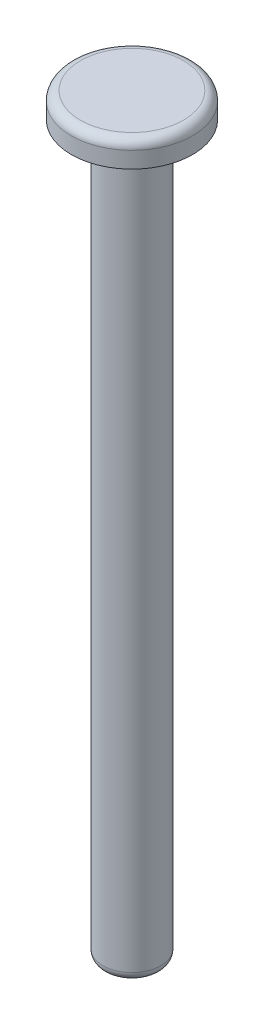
ISO-10303-21;
HEADER;
FILE_DESCRIPTION(('STEP AP214'),'2;1');
FILE_NAME('part.step','',(''),(''),'','','');
FILE_SCHEMA(('AUTOMOTIVE_DESIGN { 1 0 10303 214 1 1 1 1 }'));
ENDSEC;
DATA;
#1=APPLICATION_CONTEXT('core data for automotive mechanical design processes');
#2=APPLICATION_PROTOCOL_DEFINITION('international standard','automotive_design',2000,#1);
#3=PRODUCT_CONTEXT('',#1,'mechanical');
#4=PRODUCT('Part','Part','',(#3));
#5=PRODUCT_RELATED_PRODUCT_CATEGORY('part','',(#4));
#6=PRODUCT_DEFINITION_FORMATION('','',#4);
#7=PRODUCT_DEFINITION_CONTEXT('part definition',#1,'design');
#8=PRODUCT_DEFINITION('design','',#6,#7);
#9=PRODUCT_DEFINITION_SHAPE('','',#8);
#10=(LENGTH_UNIT() NAMED_UNIT(*) SI_UNIT(.MILLI.,.METRE.));
#11=(NAMED_UNIT(*) PLANE_ANGLE_UNIT() SI_UNIT($,.RADIAN.));
#12=(NAMED_UNIT(*) SI_UNIT($,.STERADIAN.) SOLID_ANGLE_UNIT());
#13=UNCERTAINTY_MEASURE_WITH_UNIT(LENGTH_MEASURE(1.E-05),#10,'distance_accuracy_value','');
#14=(GEOMETRIC_REPRESENTATION_CONTEXT(3) GLOBAL_UNCERTAINTY_ASSIGNED_CONTEXT((#13)) GLOBAL_UNIT_ASSIGNED_CONTEXT((#10,
#11,#12)) REPRESENTATION_CONTEXT('',''));
#15=CARTESIAN_POINT('',(0.,0.,0.));
#16=DIRECTION('',(0.,0.,1.));
#17=DIRECTION('',(1.,0.,0.));
#18=AXIS2_PLACEMENT_3D('',#15,#16,#17);
#19=CARTESIAN_POINT('',(0.,40.2,0.));
#20=DIRECTION('',(0.,-1.,0.));
#21=DIRECTION('',(0.,0.,-1.));
#22=AXIS2_PLACEMENT_3D('',#19,#20,#21);
#23=CYLINDRICAL_SURFACE('',#22,1.6);
#24=CARTESIAN_POINT('',(0.,0.5,0.));
#25=DIRECTION('',(0.,1.,0.));
#26=DIRECTION('',(0.,0.,1.));
#27=AXIS2_PLACEMENT_3D('',#24,#25,#26);
#28=CIRCLE('',#27,1.6);
#29=CARTESIAN_POINT('',(0.,0.5,1.6));
#30=VERTEX_POINT('',#29);
#31=EDGE_CURVE('E29',#30,#30,#28,.T.);
#32=ORIENTED_EDGE('',*,*,#31,.T.);
#33=EDGE_LOOP('',(#32));
#34=FACE_BOUND('',#33,.T.);
#35=CARTESIAN_POINT('',(0.,40.2,0.));
#36=DIRECTION('',(0.,1.,0.));
#37=DIRECTION('',(0.,0.,1.));
#38=AXIS2_PLACEMENT_3D('',#35,#36,#37);
#39=CIRCLE('',#38,1.6);
#40=CARTESIAN_POINT('',(0.,40.2,1.6));
#41=VERTEX_POINT('',#40);
#42=EDGE_CURVE('E34',#41,#41,#39,.T.);
#43=ORIENTED_EDGE('',*,*,#42,.F.);
#44=EDGE_LOOP('',(#43));
#45=FACE_BOUND('',#44,.T.);
#46=ADVANCED_FACE('F15',(#34,#45),#23,.T.);
#47=CARTESIAN_POINT('',(0.,0.,0.));
#48=DIRECTION('',(0.,1.,0.));
#49=DIRECTION('',(0.,0.,1.));
#50=AXIS2_PLACEMENT_3D('',#47,#48,#49);
#51=PLANE('',#50);
#52=CARTESIAN_POINT('',(0.,0.,0.));
#53=DIRECTION('',(0.,1.,0.));
#54=DIRECTION('',(0.,0.,1.));
#55=AXIS2_PLACEMENT_3D('',#52,#53,#54);
#56=CIRCLE('',#55,1.1);
#57=CARTESIAN_POINT('',(0.,0.,1.1));
#58=VERTEX_POINT('',#57);
#59=EDGE_CURVE('E25',#58,#58,#56,.F.);
#60=ORIENTED_EDGE('',*,*,#59,.T.);
#61=EDGE_LOOP('',(#60));
#62=FACE_BOUND('',#61,.T.);
#63=ADVANCED_FACE('F46',(#62),#51,.F.);
#64=CARTESIAN_POINT('',(0.,40.2,0.));
#65=DIRECTION('',(0.,1.,0.));
#66=DIRECTION('',(0.,0.,1.));
#67=AXIS2_PLACEMENT_3D('',#64,#65,#66);
#68=PLANE('',#67);
#69=CARTESIAN_POINT('',(0.,40.2,0.));
#70=DIRECTION('',(0.,1.,0.));
#71=DIRECTION('',(0.,0.,1.));
#72=AXIS2_PLACEMENT_3D('',#69,#70,#71);
#73=CIRCLE('',#72,3.35);
#74=CARTESIAN_POINT('',(0.,40.2,3.35));
#75=VERTEX_POINT('',#74);
#76=EDGE_CURVE('E37',#75,#75,#73,.T.);
#77=ORIENTED_EDGE('',*,*,#76,.F.);
#78=EDGE_LOOP('',(#77));
#79=FACE_BOUND('',#78,.T.);
#80=ORIENTED_EDGE('',*,*,#42,.T.);
#81=EDGE_LOOP('',(#80));
#82=FACE_BOUND('',#81,.T.);
#83=ADVANCED_FACE('F43',(#79,#82),#68,.F.);
#84=CARTESIAN_POINT('',(0.,41.6,0.));
#85=DIRECTION('',(0.,-1.,0.));
#86=DIRECTION('',(0.,0.,-1.));
#87=AXIS2_PLACEMENT_3D('',#84,#85,#86);
#88=CYLINDRICAL_SURFACE('',#87,3.35);
#89=CARTESIAN_POINT('',(0.,41.1,0.));
#90=DIRECTION('',(0.,1.,0.));
#91=DIRECTION('',(0.,0.,1.));
#92=AXIS2_PLACEMENT_3D('',#89,#90,#91);
#93=CIRCLE('',#92,3.35);
#94=CARTESIAN_POINT('',(0.,41.1,3.35));
#95=VERTEX_POINT('',#94);
#96=EDGE_CURVE('E10',#95,#95,#93,.F.);
#97=ORIENTED_EDGE('',*,*,#96,.T.);
#98=EDGE_LOOP('',(#97));
#99=FACE_BOUND('',#98,.T.);
#100=ORIENTED_EDGE('',*,*,#76,.T.);
#101=EDGE_LOOP('',(#100));
#102=FACE_BOUND('',#101,.T.);
#103=ADVANCED_FACE('F41',(#99,#102),#88,.T.);
#104=CARTESIAN_POINT('',(0.,41.6,0.));
#105=DIRECTION('',(0.,1.,0.));
#106=DIRECTION('',(0.,0.,1.));
#107=AXIS2_PLACEMENT_3D('',#104,#105,#106);
#108=PLANE('',#107);
#109=CARTESIAN_POINT('',(0.,41.6,0.));
#110=DIRECTION('',(0.,1.,0.));
#111=DIRECTION('',(0.,0.,1.));
#112=AXIS2_PLACEMENT_3D('',#109,#110,#111);
#113=CIRCLE('',#112,2.85);
#114=CARTESIAN_POINT('',(0.,41.6,2.85));
#115=VERTEX_POINT('',#114);
#116=EDGE_CURVE('E21',#115,#115,#113,.T.);
#117=ORIENTED_EDGE('',*,*,#116,.T.);
#118=EDGE_LOOP('',(#117));
#119=FACE_BOUND('',#118,.T.);
#120=ADVANCED_FACE('F63',(#119),#108,.T.);
#121=CARTESIAN_POINT('',(0.,0.5,0.));
#122=DIRECTION('',(0.,1.,0.));
#123=DIRECTION('',(0.,0.,1.));
#124=AXIS2_PLACEMENT_3D('',#121,#122,#123);
#125=TOROIDAL_SURFACE('',#124,1.1,0.5);
#126=ORIENTED_EDGE('',*,*,#59,.F.);
#127=EDGE_LOOP('',(#126));
#128=FACE_BOUND('',#127,.T.);
#129=ORIENTED_EDGE('',*,*,#31,.F.);
#130=EDGE_LOOP('',(#129));
#131=FACE_BOUND('',#130,.T.);
#132=ADVANCED_FACE('F60',(#128,#131),#125,.T.);
#133=CARTESIAN_POINT('',(0.,41.1,0.));
#134=DIRECTION('',(0.,1.,0.));
#135=DIRECTION('',(0.,0.,1.));
#136=AXIS2_PLACEMENT_3D('',#133,#134,#135);
#137=TOROIDAL_SURFACE('',#136,2.85,0.5);
#138=ORIENTED_EDGE('',*,*,#96,.F.);
#139=EDGE_LOOP('',(#138));
#140=FACE_BOUND('',#139,.T.);
#141=ORIENTED_EDGE('',*,*,#116,.F.);
#142=EDGE_LOOP('',(#141));
#143=FACE_BOUND('',#142,.T.);
#144=ADVANCED_FACE('F62',(#140,#143),#137,.T.);
#145=CLOSED_SHELL('',(#46,#63,#83,#103,#120,#132,#144));
#146=MANIFOLD_SOLID_BREP('B1',#145);
#147=ADVANCED_BREP_SHAPE_REPRESENTATION('',(#18,#146),#14);
#148=SHAPE_DEFINITION_REPRESENTATION(#9,#147);
ENDSEC;
END-ISO-10303-21;
